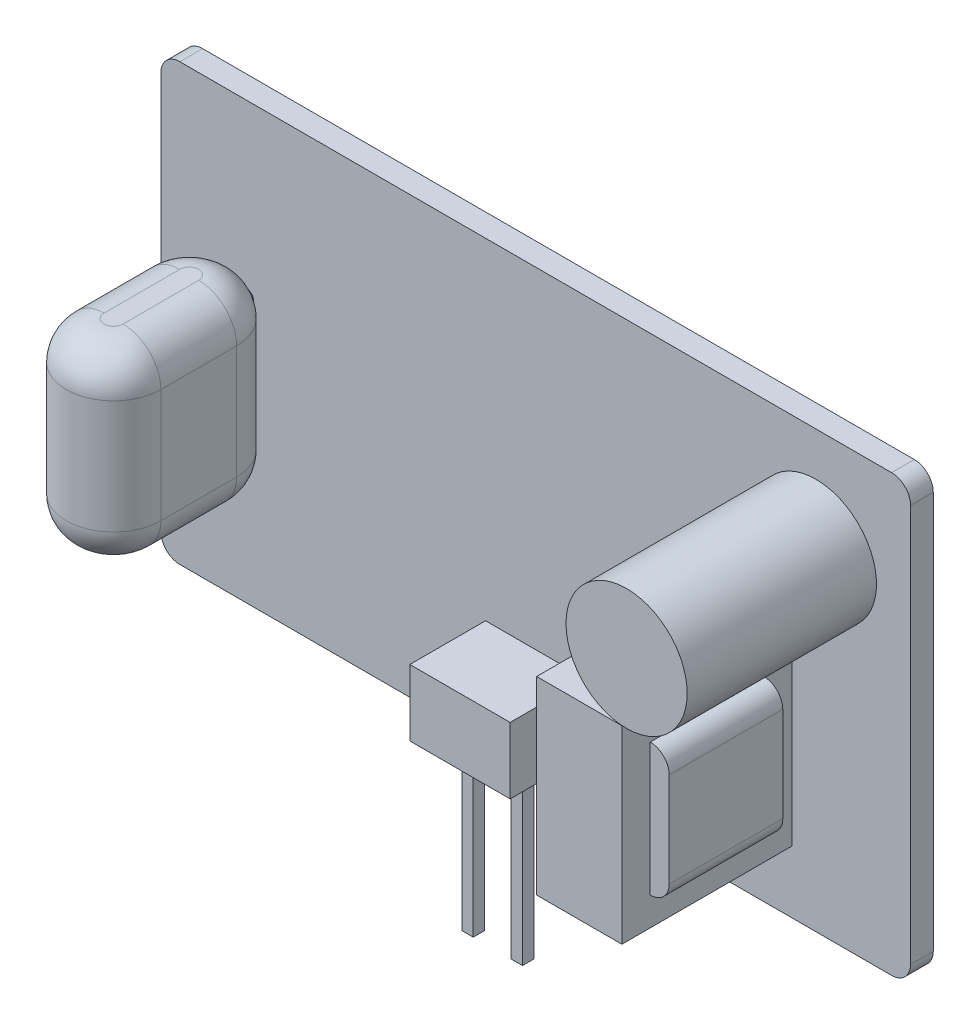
from build123d import *

# Parameters (mm, degrees)
BOSS_EXTRU_1_DEPTH             = 1.2
ESQUISSE2_R                    = 3.2
BOSS_EXTRU_2_DEPTH             = 10
ESQUISSE3_W                    = 9
ESQUISSE3_H                    = 10
ESQUISSE3_W_2                  = 6
ESQUISSE3_H_2                  = 7
BOSS_EXTRU_3_DEPTH             = 2.25
BOSS_EXTRU_4_DEPTH             = 6
ESQUISSE5_W                    = 5.3
ESQUISSE5_H                    = 3.5
BOSS_EXTRU_5_DEPTH             = 4
ESQUISSE6_W                    = 0.6
ESQUISSE6_H                    = 0.6
BOSS_EXTRU_6_DEPTH             = 9
BOSS_EXTRU_7_DEPTH             = 5
CONG_1_R                       = 2
BOSS_EXTRU_8_REACH             = 30.884
BOSS_EXTRU_8_END_RADIUS        = 2.5
ESQUISSE8_R                    = 0.4
BOSS_EXTRU_8_DIRECTION_2_DEPTH = 2.2


with BuildPart() as part:
    # Esquisse1 → Boss.-Extru.1 (new body)
    with BuildSketch(Plane.XY):
        with BuildLine():
            Line((-18.8, -11.5), (18.8, -11.5))
            ThreePointArc((18.8, -11.5), (19.507106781, -11.207106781), (19.8, -10.5))
            Line((19.8, -10.5), (19.8, 10.5))
            ThreePointArc((19.8, 10.5), (19.507106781, 11.207106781), (18.8, 11.5))
            Line((18.8, 11.5), (-18.8, 11.5))
            ThreePointArc((-18.8, 11.5), (-19.507106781, 11.207106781), (-19.8, 10.5))
            Line((-19.8, 10.5), (-19.8, -10.5))
            ThreePointArc((-19.8, -10.5), (-19.507106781, -11.207106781), (-18.8, -11.5))
        make_face()
    extrude(amount=BOSS_EXTRU_1_DEPTH)

    # Esquisse2 → Boss.-Extru.2 (add)
    with BuildSketch(Plane.XY.offset(1.2)):
        with Locations(Location((14.8, 6, 0), (0, 0, 180))):
            Circle(ESQUISSE2_R)
    extrude(amount=BOSS_EXTRU_2_DEPTH)

    # Esquisse3 → Boss.-Extru.3 (add, symmetric)
    with BuildSketch(Plane(origin=(11.3, 0, 0), x_dir=(0, 0, -1), z_dir=(1, 0, 0))):
        with Locations((-5.7, -3.2)):
            Rectangle(ESQUISSE3_W, ESQUISSE3_H)
        with Locations((-5.7, -3.2)):
            Rectangle(ESQUISSE3_W_2, ESQUISSE3_H_2, mode=Mode.SUBTRACT)
    extrude(amount=BOSS_EXTRU_3_DEPTH, both=True)

    # Esquisse4 → Boss.-Extru.4 (add)
    with BuildSketch(Plane.XY.offset(2.7)):
        with BuildLine():
            Line((9.05, 0.3), (13.55, 0.3))
            ThreePointArc((13.55, 0.3), (14.257106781, 0.007106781), (14.55, -0.7))
            Line((14.55, -0.7), (14.55, -5.7))
            ThreePointArc((14.55, -5.7), (14.257106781, -6.407106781), (13.55, -6.7))
            Line((13.55, -6.7), (9.05, -6.7))
            ThreePointArc((9.05, -6.7), (8.342893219, -6.407106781), (8.05, -5.7))
            Line((8.05, -5.7), (8.05, -0.7))
            ThreePointArc((8.05, -0.7), (8.342893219, 0.007106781), (9.05, 0.3))
        make_face()
    extrude(amount=BOSS_EXTRU_4_DEPTH)

    # Esquisse5 → Boss.-Extru.5 (add)
    with BuildSketch(Plane.XY.offset(1.2)):
        with Locations((0, -7.75)):
            Rectangle(ESQUISSE5_W, ESQUISSE5_H)
    extrude(amount=BOSS_EXTRU_5_DEPTH)

    # Esquisse6 → Boss.-Extru.6 (add)
    with BuildSketch(Plane.XZ.offset(9.5)):
        with Locations((1.3, 3.2)):
            Rectangle(ESQUISSE6_W, ESQUISSE6_H)
        with Locations((-1.3, 3.2)):
            Rectangle(ESQUISSE6_W, ESQUISSE6_H)
    extrude(amount=BOSS_EXTRU_6_DEPTH)



with BuildPart() as body_2:
    # Esquisse7 → Boss.-Extru.7 (new, symmetric)
    with BuildSketch(Plane(origin=(0, 0, 0), x_dir=(1, 0, 0), z_dir=(0, 1, 0))):
        with BuildLine():
            Line((-12.8, -4.2), (-12.8, -8.2))
            ThreePointArc((-12.8, -8.2), (-15.3, -10.7), (-17.8, -8.2))
            Line((-17.8, -8.2), (-17.8, -4.2))
            ThreePointArc((-17.8, -4.2), (-15.3, -1.7), (-12.8, -4.2))
        make_face()
    extrude(amount=BOSS_EXTRU_7_DEPTH, both=True)

    # Cong_1
    cong_1_edges = [body_2.edges().sort_by_distance(p)[0] for p in [
        (-15.3, 5, 10.7),
        (-12.8, 5, 6.2),
        (-15.3, 5, 1.7),
        (-12.8, -5, 6.2),
        (-15.3, -5, 10.7),
        (-17.8, -5, 6.2),
        (-15.3, -5, 1.7),
        (-17.8, 5, 6.2),
    ]]
    fillet(cong_1_edges, radius=CONG_1_R)


with BuildPart() as part_1:
    add(part.part)

    add(body_2.part)  # Boss.-Extru.8 merges body 2
    # Boss.-Extru.8: up to this cylinder (the profile starts outside it)
    boss_extru_8_end = Plane(origin=(-15.3, 0, 4.2), z_dir=(0, -1, 0)) * Cylinder(BOSS_EXTRU_8_END_RADIUS, 72.768, mode=Mode.PRIVATE)
    # Esquisse8 → Boss.-Extru.8 (add, up to the surface)
    with BuildSketch(Plane.XY.offset(1.2), mode=Mode.PRIVATE) as boss_extru_8_sk1:
        with Locations(Location((-15.3, 2.5, 0), (0, 0, 180))):
            Circle(ESQUISSE8_R)
    boss_extru_8_tool1 = extrude(boss_extru_8_sk1.sketch, amount=BOSS_EXTRU_8_REACH, mode=Mode.PRIVATE) - boss_extru_8_end
    add(boss_extru_8_tool1.solids().sort_by_distance((-15.3, 2.5, 1.2))[0])
    # Esquisse8 → Boss.-Extru.8 (add, up to the surface)
    with BuildSketch(Plane.XY.offset(1.2), mode=Mode.PRIVATE) as boss_extru_8_sk2:
        with Locations(Location((-15.3, -2.5, 0), (0, 0, 180))):
            Circle(ESQUISSE8_R)
    boss_extru_8_tool2 = extrude(boss_extru_8_sk2.sketch, amount=BOSS_EXTRU_8_REACH, mode=Mode.PRIVATE) - boss_extru_8_end
    add(boss_extru_8_tool2.solids().sort_by_distance((-15.3, -2.5, 1.2))[0])

    # Esquisse8 → Boss.-Extru.8 direction 2 (add)
    with BuildSketch(Plane.XY.offset(1.2)):
        with Locations(Location((-15.3, 2.5, 0), (0, 0, 180))):
            Circle(ESQUISSE8_R)
        with Locations(Location((-15.3, -2.5, 0), (0, 0, 180))):
            Circle(ESQUISSE8_R)
    extrude(amount=-BOSS_EXTRU_8_DIRECTION_2_DEPTH)


solid = part_1.part
